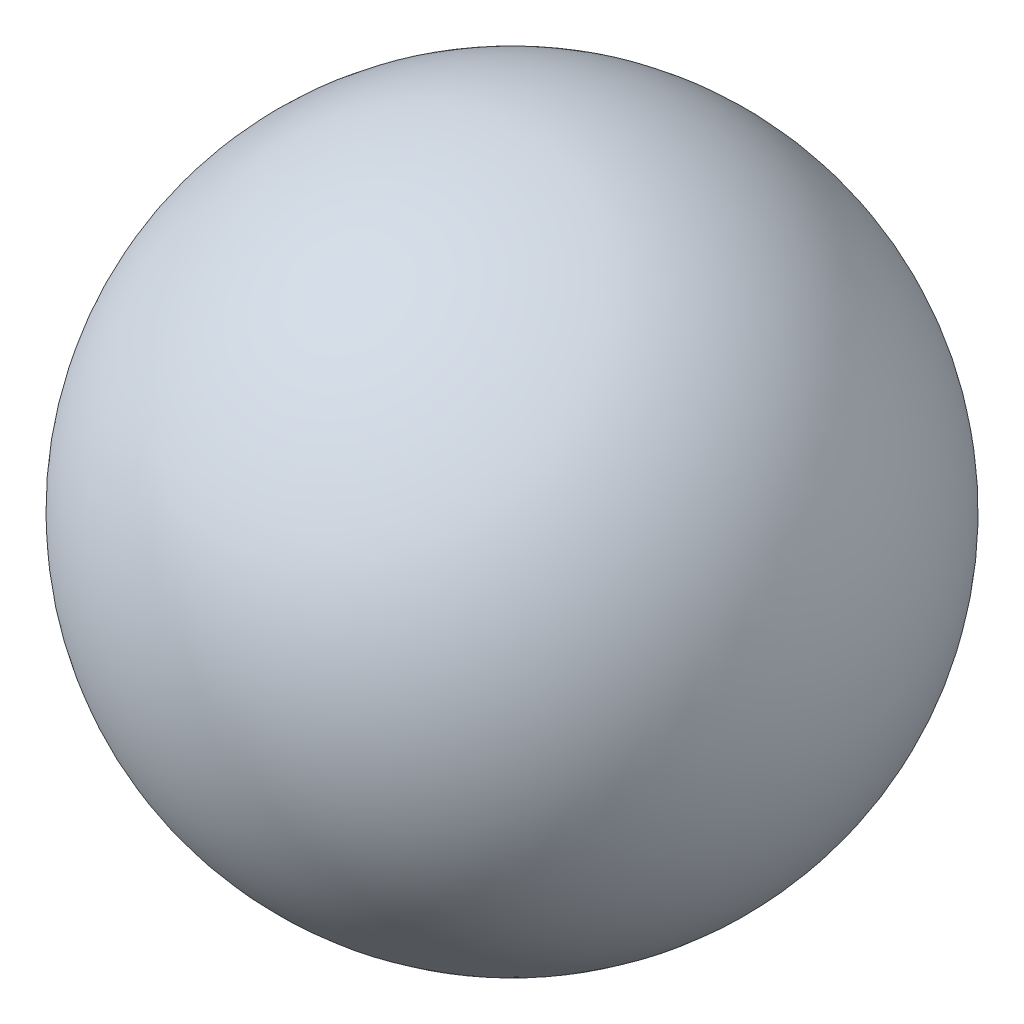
from build123d import *

# Parameters (mm, degrees)
SKETCH2_W             = 12.236245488
SKETCH2_H             = 8.042602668
EXTRUDE1_DEPTH        = 10
M4_TAPPED_HOLE1_D     = 3.3
M4_TAPPED_HOLE1_DEPTH = 10
M4_TAPPED_HOLE1_TIP   = 0.991420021


with BuildPart() as part:
    # Sketch1 → Revolve1 (revolve)
    with BuildSketch(Plane.XY):
        with BuildLine():
            Line((0, 9.5), (0, -9.5))
            ThreePointArc((0, -9.5), (9.5, 0), (0, 9.5))
        make_face()
    revolve(axis=Axis((0, 9.5, 0), (0, -1, 0)))

    # Sketch2 → Extrude1 (cut)
    with BuildSketch(Plane(origin=(0, -9, 0), x_dir=(-1, 0, 0), z_dir=(0, 1, 0))):
        with Locations((0.746813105, -0.201065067)):
            Rectangle(SKETCH2_W, SKETCH2_H)
    extrude(amount=-EXTRUDE1_DEPTH, mode=Mode.SUBTRACT)

    # M4 Tapped Hole1
    with Locations(Plane(origin=(0, -9, 0), x_dir=(0, 0, -1), z_dir=(0, -1, 0))):
        with Locations((0, 0)):
            Hole(M4_TAPPED_HOLE1_D / 2, depth=M4_TAPPED_HOLE1_DEPTH)
            with Locations((0, 0, -(M4_TAPPED_HOLE1_DEPTH + M4_TAPPED_HOLE1_TIP / 2))):  # 118° drill point
                Cone(0, M4_TAPPED_HOLE1_D / 2, M4_TAPPED_HOLE1_TIP, mode=Mode.SUBTRACT)


solid = part.part
